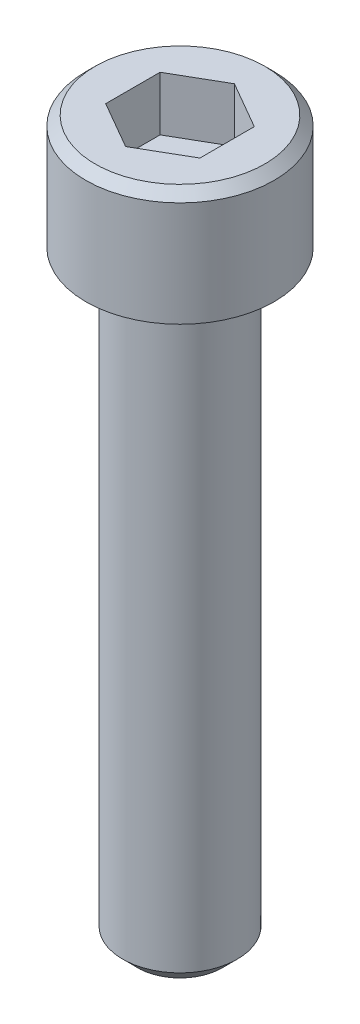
from build123d import *

# Parameters (mm, degrees)
CUT_EXTRUDE1_DEPTH = 2.286


with BuildPart() as part:
    # Sketch1 → Base-Revolve (revolve)
    with BuildSketch(Plane.XY, mode=Mode.PRIVATE) as base_revolve_sk:
        Polygon((0, 0), (3.96875, 0), (3.96875, 4.429125), (3.571875, 4.826), (0, 4.826), align=None)
    revolve(base_revolve_sk.sketch.rotate(Axis((0, 0, 0), (0, 1, 0)), 90), axis=Axis((0, 0, 0), (0, 1, 0)))

    # Sketch2 → Boss-Revolve1 (revolve)
    with BuildSketch(Plane.XY, mode=Mode.PRIVATE) as boss_revolve1_sk:
        Polygon((0, -25.4), (1.78308, -25.4), (2.413, -24.77008), (2.413, 0), (0, 0), align=None)
    revolve(boss_revolve1_sk.sketch.rotate(Axis((0, 0, 0), (0, 1, 0)), 90), axis=Axis((0, 0, 0), (0, 1, 0)))

    # Sketch3 → Cut-Extrude1 (cut)
    with BuildSketch(Plane(origin=(0, 4.826, 0), x_dir=(-1, 0, 0), z_dir=(0, 1, 0))):
        Polygon((1.98501, 1.146046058), (0, 2.292092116), (-1.98501, 1.146046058), (-1.98501, -1.146046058), (0, -2.292092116), (1.98501, -1.146046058), align=None)
    extrude(amount=-CUT_EXTRUDE1_DEPTH, mode=Mode.SUBTRACT)


solid = part.part
